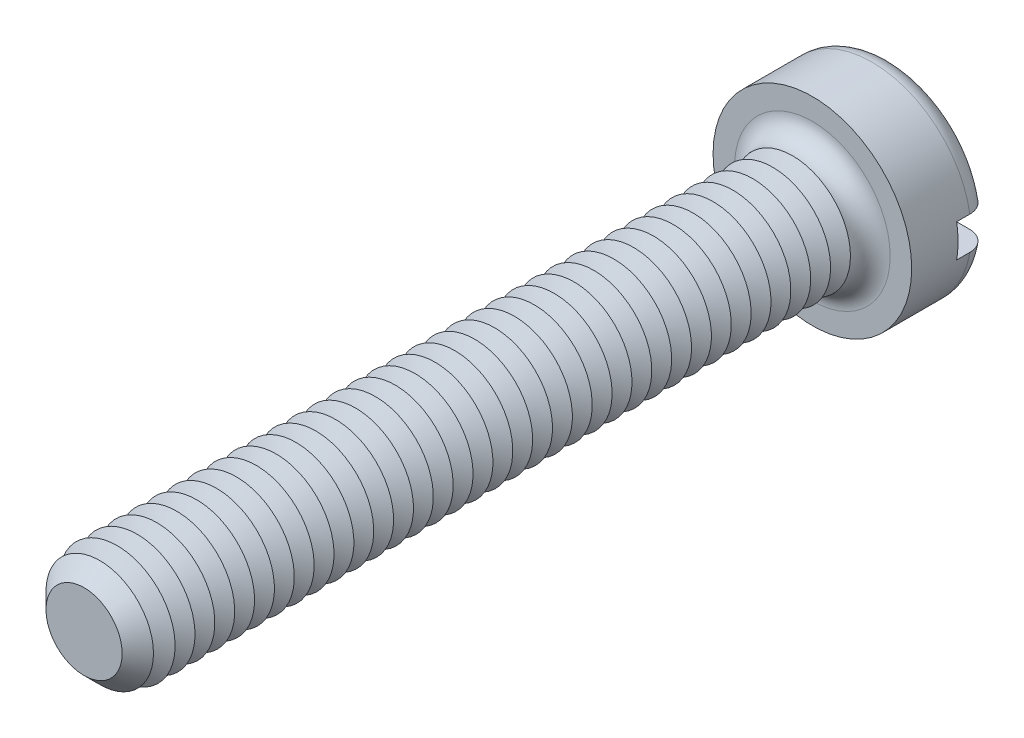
from build123d import *

# Parameters (mm, degrees)
SKETCH3_R           = 3
BOSS_EXTRUDE2_DEPTH = 2.4
SKETCH4_R           = 1.75
BOSS_EXTRUDE3_DEPTH = 22
FILLET1_R           = 0.6
CHAMFER1_SIZE       = 0.6
LPATTERN1_COUNT     = 35
LPATTERN1_PITCH     = 0.6
SKETCH8_W           = 6
SKETCH8_H           = 1
CUT_EXTRUDE1_DEPTH  = 1


with BuildPart() as part:
    # Sketch3 → Boss-Extrude2 (new body)
    with BuildSketch(Plane.XY):
        Circle(SKETCH3_R)
    extrude(amount=-BOSS_EXTRUDE2_DEPTH)

    # Sketch4 → Boss-Extrude3 (add)
    with BuildSketch(Plane.XY):
        Circle(SKETCH4_R)
    extrude(amount=BOSS_EXTRUDE3_DEPTH)

    # Fillet1
    fillet1_edges = [part.edges().sort_by_distance(p)[0] for p in [
        (-3, 0, -2.4),
        (-1.75, 0, 0),
    ]]
    fillet(fillet1_edges, radius=FILLET1_R)

    # Chamfer1
    chamfer1_edges = [part.edges().sort_by_distance(p)[0] for p in [
        (-1.75, 0, 22),
    ]]
    chamfer(chamfer1_edges, length=CHAMFER1_SIZE)

    # Sketch6 → Cut-Revolve1 (revolve, cut)
    with BuildSketch(Plane(origin=(0, 0, 0), x_dir=(0, 0, -1), z_dir=(1, 0, 0)), mode=Mode.PRIVATE) as cut_revolve1_sk:
        Polygon((-0.6, 1.75), (-0.9, 1.230384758), (-1.2, 1.75), align=None)
    cut_revolve1 = revolve(cut_revolve1_sk.sketch.rotate(Axis((0, 0, -1.694361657), (0, 0, 1)), 90), axis=Axis((0, 0, -1.694361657), (0, 0, 1)), mode=Mode.SUBTRACT)

    # LPattern1: Cut-Revolve1 ×35
    with Locations(*[(0, 0, i * LPATTERN1_PITCH) for i in range(1, LPATTERN1_COUNT)]):
        add(cut_revolve1, mode=Mode.SUBTRACT)

    # Sketch8 → Cut-Extrude1 (cut)
    with BuildSketch(Plane(origin=(0, 0, -2.4), x_dir=(-1, 0, 0), z_dir=(0, 0, -1))):
        Rectangle(SKETCH8_W, SKETCH8_H)
    extrude(amount=-CUT_EXTRUDE1_DEPTH, mode=Mode.SUBTRACT)


solid = part.part
